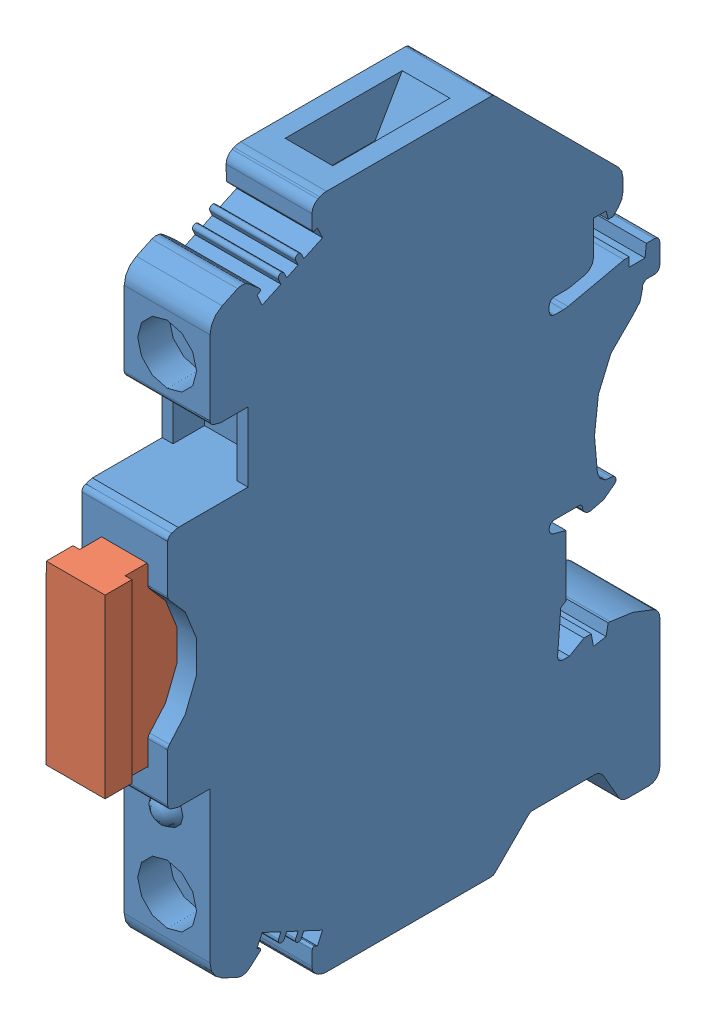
SolidWorks assembly UK6-fsi fused.SLDASM, configuration Default (file format 5000). Lengths in mm.
Overall size (8.17 64.21 51.36).
2 component instances, 2 part files, 3 mates.
Components (placement in the parent):
- 3118203_uk_6_fs-c_select-1: 3118203_uk_6_fs-c_select.sldprt [Default] at (-86.1178 45.6786 14.4098) size (8.17 64.21 46.74)
- fusetop-1: fusetop.SLDPRT [Default] at (6.9864 27.5076 61.3042) x (-1 0.000226 0) z (0 0 -1) size (5.59 16.76 7.62)
Mates (geometry in assembly coordinates):
- Coincident1: coincident: point of 3118203_uk_6_fs-c_select-1; point of fusetop-1
- Coincident4: coincident: line of 3118203_uk_6_fs-c_select-1 through (15.1006 27.5058 69.5384) axis (-1 0.000226 0); line of fusetop-1 through (15.0141 27.5058 69.5384) axis (-1 0.000226 0)
- Coincident7: coincident anti-aligned: plane of 3118203_uk_6_fs-c_select-1 through (10.6961 44.1836 69.5384) normal (0 0 1); plane of fusetop-1 through (15.0179 44.2698 69.5384) normal (0 0 -1)
